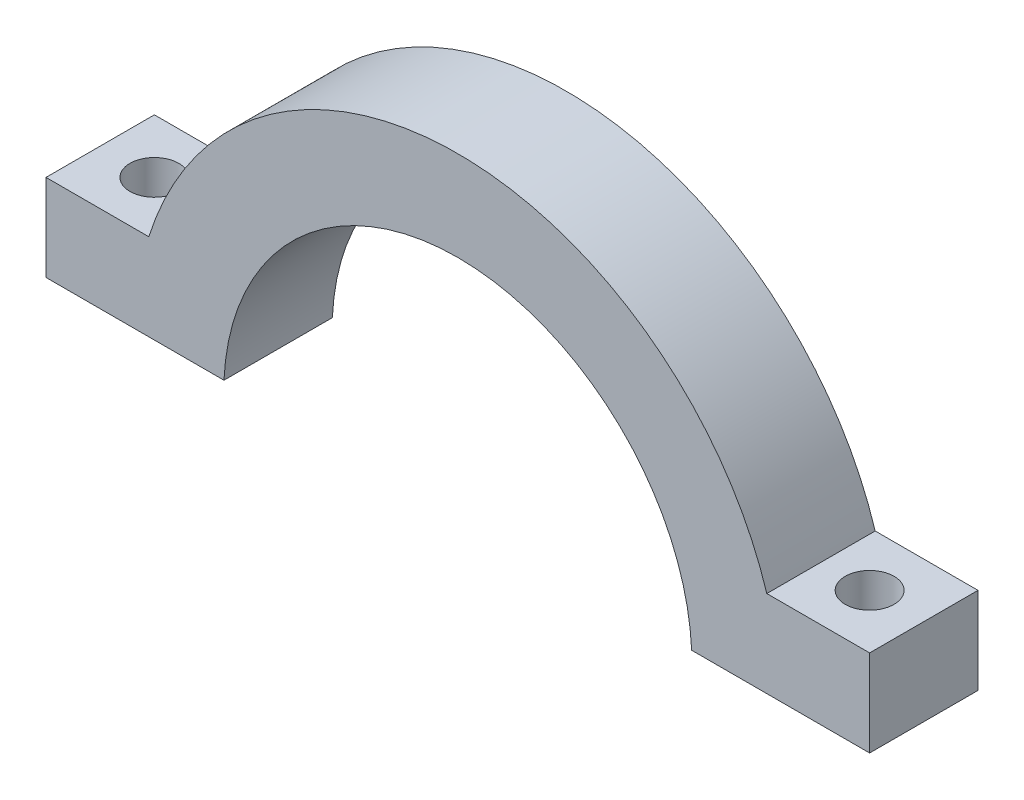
ISO-10303-21;
HEADER;
FILE_DESCRIPTION(('STEP AP214'),'2;1');
FILE_NAME('part.step','',(''),(''),'','','');
FILE_SCHEMA(('AUTOMOTIVE_DESIGN { 1 0 10303 214 1 1 1 1 }'));
ENDSEC;
DATA;
#1=APPLICATION_CONTEXT('core data for automotive mechanical design processes');
#2=APPLICATION_PROTOCOL_DEFINITION('international standard','automotive_design',2000,#1);
#3=PRODUCT_CONTEXT('',#1,'mechanical');
#4=PRODUCT('Part','Part','',(#3));
#5=PRODUCT_RELATED_PRODUCT_CATEGORY('part','',(#4));
#6=PRODUCT_DEFINITION_FORMATION('','',#4);
#7=PRODUCT_DEFINITION_CONTEXT('part definition',#1,'design');
#8=PRODUCT_DEFINITION('design','',#6,#7);
#9=PRODUCT_DEFINITION_SHAPE('','',#8);
#10=(LENGTH_UNIT() NAMED_UNIT(*) SI_UNIT(.MILLI.,.METRE.));
#11=(NAMED_UNIT(*) PLANE_ANGLE_UNIT() SI_UNIT($,.RADIAN.));
#12=(NAMED_UNIT(*) SI_UNIT($,.STERADIAN.) SOLID_ANGLE_UNIT());
#13=UNCERTAINTY_MEASURE_WITH_UNIT(LENGTH_MEASURE(1.E-05),#10,'distance_accuracy_value','');
#14=(GEOMETRIC_REPRESENTATION_CONTEXT(3) GLOBAL_UNCERTAINTY_ASSIGNED_CONTEXT((#13)) GLOBAL_UNIT_ASSIGNED_CONTEXT((#10,
#11,#12)) REPRESENTATION_CONTEXT('',''));
#15=CARTESIAN_POINT('',(0.,0.,0.));
#16=DIRECTION('',(0.,0.,1.));
#17=DIRECTION('',(1.,0.,0.));
#18=AXIS2_PLACEMENT_3D('',#15,#16,#17);
#19=CARTESIAN_POINT('',(241.3,6.35,63.5));
#20=DIRECTION('',(-1.,0.,0.));
#21=DIRECTION('',(0.,-1.,0.));
#22=AXIS2_PLACEMENT_3D('',#19,#20,#21);
#23=PLANE('',#22);
#24=DIRECTION('',(0.,1.,0.));
#25=VECTOR('',#24,1.);
#26=CARTESIAN_POINT('',(241.3,6.35,0.));
#27=LINE('',#26,#25);
#28=CARTESIAN_POINT('',(241.3,6.35,0.));
#29=VERTEX_POINT('',#28);
#30=CARTESIAN_POINT('',(241.3,57.15,0.));
#31=VERTEX_POINT('',#30);
#32=EDGE_CURVE('E443',#29,#31,#27,.T.);
#33=ORIENTED_EDGE('',*,*,#32,.T.);
#34=DIRECTION('',(0.,0.,-1.));
#35=VECTOR('',#34,1.);
#36=CARTESIAN_POINT('',(241.3,57.15,63.5));
#37=LINE('',#36,#35);
#38=CARTESIAN_POINT('',(241.3,57.15,63.5));
#39=VERTEX_POINT('',#38);
#40=EDGE_CURVE('E11',#39,#31,#37,.T.);
#41=ORIENTED_EDGE('',*,*,#40,.F.);
#42=DIRECTION('',(0.,1.,0.));
#43=VECTOR('',#42,1.);
#44=CARTESIAN_POINT('',(241.3,6.35,63.5));
#45=LINE('',#44,#43);
#46=CARTESIAN_POINT('',(241.3,6.35,63.5));
#47=VERTEX_POINT('',#46);
#48=EDGE_CURVE('E475',#47,#39,#45,.T.);
#49=ORIENTED_EDGE('',*,*,#48,.F.);
#50=DIRECTION('',(0.,0.,-1.));
#51=VECTOR('',#50,1.);
#52=CARTESIAN_POINT('',(241.3,6.35,63.5));
#53=LINE('',#52,#51);
#54=EDGE_CURVE('E456',#47,#29,#53,.T.);
#55=ORIENTED_EDGE('',*,*,#54,.T.);
#56=EDGE_LOOP('',(#33,#41,#49,#55));
#57=FACE_BOUND('',#56,.T.);
#58=ADVANCED_FACE('F375',(#57),#23,.F.);
#59=CARTESIAN_POINT('',(181.059646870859,57.15,63.5));
#60=DIRECTION('',(0.,-1.,0.));
#61=DIRECTION('',(0.,0.,-1.));
#62=AXIS2_PLACEMENT_3D('',#59,#60,#61);
#63=PLANE('',#62);
#64=CARTESIAN_POINT('',(209.55,57.1500000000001,31.75));
#65=DIRECTION('',(0.,1.,0.));
#66=DIRECTION('',(0.,0.,1.));
#67=AXIS2_PLACEMENT_3D('',#64,#65,#66);
#68=CIRCLE('',#67,14.2875);
#69=CARTESIAN_POINT('',(209.55,57.15,46.0375));
#70=VERTEX_POINT('',#69);
#71=EDGE_CURVE('E568',#70,#70,#68,.T.);
#72=ORIENTED_EDGE('',*,*,#71,.F.);
#73=EDGE_LOOP('',(#72));
#74=FACE_BOUND('',#73,.T.);
#75=DIRECTION('',(-1.,0.,0.));
#76=VECTOR('',#75,1.);
#77=CARTESIAN_POINT('',(181.059646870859,57.15,0.));
#78=LINE('',#77,#76);
#79=CARTESIAN_POINT('',(181.059646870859,57.15,0.));
#80=VERTEX_POINT('',#79);
#81=EDGE_CURVE('E439',#31,#80,#78,.T.);
#82=ORIENTED_EDGE('',*,*,#81,.T.);
#83=DIRECTION('',(0.,0.,-1.));
#84=VECTOR('',#83,1.);
#85=CARTESIAN_POINT('',(181.059646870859,57.15,63.5));
#86=LINE('',#85,#84);
#87=CARTESIAN_POINT('',(181.059646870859,57.15,63.5));
#88=VERTEX_POINT('',#87);
#89=EDGE_CURVE('E382',#88,#80,#86,.T.);
#90=ORIENTED_EDGE('',*,*,#89,.F.);
#91=DIRECTION('',(-1.,0.,0.));
#92=VECTOR('',#91,1.);
#93=CARTESIAN_POINT('',(181.059646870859,57.15,63.5));
#94=LINE('',#93,#92);
#95=EDGE_CURVE('E452',#39,#88,#94,.T.);
#96=ORIENTED_EDGE('',*,*,#95,.F.);
#97=ORIENTED_EDGE('',*,*,#40,.T.);
#98=EDGE_LOOP('',(#82,#90,#96,#97));
#99=FACE_BOUND('',#98,.T.);
#100=ADVANCED_FACE('F451',(#74,#99),#63,.F.);
#101=CARTESIAN_POINT('',(0.,0.,63.5));
#102=DIRECTION('',(0.,0.,-1.));
#103=DIRECTION('',(-1.,0.,0.));
#104=AXIS2_PLACEMENT_3D('',#101,#102,#103);
#105=CYLINDRICAL_SURFACE('',#104,189.865);
#106=CARTESIAN_POINT('',(0.,0.,0.));
#107=DIRECTION('',(0.,0.,1.));
#108=DIRECTION('',(1.,0.,0.));
#109=AXIS2_PLACEMENT_3D('',#106,#107,#108);
#110=CIRCLE('',#109,189.865);
#111=CARTESIAN_POINT('',(-181.059646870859,57.15,0.));
#112=VERTEX_POINT('',#111);
#113=EDGE_CURVE('E445',#80,#112,#110,.T.);
#114=ORIENTED_EDGE('',*,*,#113,.T.);
#115=DIRECTION('',(0.,0.,-1.));
#116=VECTOR('',#115,1.);
#117=CARTESIAN_POINT('',(-181.059646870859,57.15,63.5));
#118=LINE('',#117,#116);
#119=CARTESIAN_POINT('',(-181.059646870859,57.15,63.5));
#120=VERTEX_POINT('',#119);
#121=EDGE_CURVE('E501',#120,#112,#118,.T.);
#122=ORIENTED_EDGE('',*,*,#121,.F.);
#123=CARTESIAN_POINT('',(0.,0.,63.5));
#124=DIRECTION('',(0.,0.,1.));
#125=DIRECTION('',(1.,0.,0.));
#126=AXIS2_PLACEMENT_3D('',#123,#124,#125);
#127=CIRCLE('',#126,189.865);
#128=EDGE_CURVE('E478',#88,#120,#127,.T.);
#129=ORIENTED_EDGE('',*,*,#128,.F.);
#130=ORIENTED_EDGE('',*,*,#89,.T.);
#131=EDGE_LOOP('',(#114,#122,#129,#130));
#132=FACE_BOUND('',#131,.T.);
#133=ADVANCED_FACE('F505',(#132),#105,.T.);
#134=CARTESIAN_POINT('',(-181.059646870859,57.15,63.5));
#135=DIRECTION('',(0.,-1.,0.));
#136=DIRECTION('',(1.,0.,0.));
#137=AXIS2_PLACEMENT_3D('',#134,#135,#136);
#138=PLANE('',#137);
#139=CARTESIAN_POINT('',(-209.55,57.1500000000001,31.75));
#140=DIRECTION('',(0.,1.,0.));
#141=DIRECTION('',(0.,0.,1.));
#142=AXIS2_PLACEMENT_3D('',#139,#140,#141);
#143=CIRCLE('',#142,14.2875);
#144=CARTESIAN_POINT('',(-209.55,57.15,46.0375));
#145=VERTEX_POINT('',#144);
#146=EDGE_CURVE('E460',#145,#145,#143,.T.);
#147=ORIENTED_EDGE('',*,*,#146,.F.);
#148=EDGE_LOOP('',(#147));
#149=FACE_BOUND('',#148,.T.);
#150=DIRECTION('',(-1.,0.,0.));
#151=VECTOR('',#150,1.);
#152=CARTESIAN_POINT('',(-181.059646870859,57.15,0.));
#153=LINE('',#152,#151);
#154=CARTESIAN_POINT('',(-241.3,57.15,0.));
#155=VERTEX_POINT('',#154);
#156=EDGE_CURVE('E465',#112,#155,#153,.T.);
#157=ORIENTED_EDGE('',*,*,#156,.T.);
#158=DIRECTION('',(0.,0.,-1.));
#159=VECTOR('',#158,1.);
#160=CARTESIAN_POINT('',(-241.3,57.15,63.5));
#161=LINE('',#160,#159);
#162=CARTESIAN_POINT('',(-241.3,57.15,63.5));
#163=VERTEX_POINT('',#162);
#164=EDGE_CURVE('E498',#163,#155,#161,.T.);
#165=ORIENTED_EDGE('',*,*,#164,.F.);
#166=DIRECTION('',(-1.,0.,0.));
#167=VECTOR('',#166,1.);
#168=CARTESIAN_POINT('',(-181.059646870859,57.15,63.5));
#169=LINE('',#168,#167);
#170=EDGE_CURVE('E480',#120,#163,#169,.T.);
#171=ORIENTED_EDGE('',*,*,#170,.F.);
#172=ORIENTED_EDGE('',*,*,#121,.T.);
#173=EDGE_LOOP('',(#157,#165,#171,#172));
#174=FACE_BOUND('',#173,.T.);
#175=ADVANCED_FACE('F513',(#149,#174),#138,.F.);
#176=CARTESIAN_POINT('',(-241.3,6.35,63.5));
#177=DIRECTION('',(1.,0.,0.));
#178=DIRECTION('',(0.,1.,0.));
#179=AXIS2_PLACEMENT_3D('',#176,#177,#178);
#180=PLANE('',#179);
#181=DIRECTION('',(0.,-1.,0.));
#182=VECTOR('',#181,1.);
#183=CARTESIAN_POINT('',(-241.3,6.35,0.));
#184=LINE('',#183,#182);
#185=CARTESIAN_POINT('',(-241.3,6.35,0.));
#186=VERTEX_POINT('',#185);
#187=EDGE_CURVE('E467',#155,#186,#184,.T.);
#188=ORIENTED_EDGE('',*,*,#187,.T.);
#189=DIRECTION('',(0.,0.,-1.));
#190=VECTOR('',#189,1.);
#191=CARTESIAN_POINT('',(-241.3,6.35,63.5));
#192=LINE('',#191,#190);
#193=CARTESIAN_POINT('',(-241.3,6.35,63.5));
#194=VERTEX_POINT('',#193);
#195=EDGE_CURVE('E495',#194,#186,#192,.T.);
#196=ORIENTED_EDGE('',*,*,#195,.F.);
#197=DIRECTION('',(0.,-1.,0.));
#198=VECTOR('',#197,1.);
#199=CARTESIAN_POINT('',(-241.3,6.35,63.5));
#200=LINE('',#199,#198);
#201=EDGE_CURVE('E482',#163,#194,#200,.T.);
#202=ORIENTED_EDGE('',*,*,#201,.F.);
#203=ORIENTED_EDGE('',*,*,#164,.T.);
#204=EDGE_LOOP('',(#188,#196,#202,#203));
#205=FACE_BOUND('',#204,.T.);
#206=ADVANCED_FACE('F516',(#205),#180,.F.);
#207=CARTESIAN_POINT('',(-241.3,6.35,63.5));
#208=DIRECTION('',(0.,1.,0.));
#209=DIRECTION('',(-1.,0.,0.));
#210=AXIS2_PLACEMENT_3D('',#207,#208,#209);
#211=PLANE('',#210);
#212=CARTESIAN_POINT('',(-209.55,6.34999999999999,31.75));
#213=DIRECTION('',(0.,1.,0.));
#214=DIRECTION('',(0.,0.,1.));
#215=AXIS2_PLACEMENT_3D('',#212,#213,#214);
#216=CIRCLE('',#215,14.2875);
#217=CARTESIAN_POINT('',(-209.55,6.34999999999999,46.0375));
#218=VERTEX_POINT('',#217);
#219=EDGE_CURVE('E457',#218,#218,#216,.T.);
#220=ORIENTED_EDGE('',*,*,#219,.T.);
#221=EDGE_LOOP('',(#220));
#222=FACE_BOUND('',#221,.T.);
#223=DIRECTION('',(1.,0.,0.));
#224=VECTOR('',#223,1.);
#225=CARTESIAN_POINT('',(-241.3,6.35,0.));
#226=LINE('',#225,#224);
#227=CARTESIAN_POINT('',(-137.012930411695,6.34999999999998,0.));
#228=VERTEX_POINT('',#227);
#229=EDGE_CURVE('E469',#186,#228,#226,.T.);
#230=ORIENTED_EDGE('',*,*,#229,.T.);
#231=DIRECTION('',(0.,0.,-1.));
#232=VECTOR('',#231,1.);
#233=CARTESIAN_POINT('',(-137.012930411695,6.34999999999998,63.5));
#234=LINE('',#233,#232);
#235=CARTESIAN_POINT('',(-137.012930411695,6.34999999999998,63.5));
#236=VERTEX_POINT('',#235);
#237=EDGE_CURVE('E492',#236,#228,#234,.T.);
#238=ORIENTED_EDGE('',*,*,#237,.F.);
#239=DIRECTION('',(1.,0.,0.));
#240=VECTOR('',#239,1.);
#241=CARTESIAN_POINT('',(-241.3,6.35,63.5));
#242=LINE('',#241,#240);
#243=EDGE_CURVE('E484',#194,#236,#242,.T.);
#244=ORIENTED_EDGE('',*,*,#243,.F.);
#245=ORIENTED_EDGE('',*,*,#195,.T.);
#246=EDGE_LOOP('',(#230,#238,#244,#245));
#247=FACE_BOUND('',#246,.T.);
#248=ADVANCED_FACE('F521',(#222,#247),#211,.F.);
#249=CARTESIAN_POINT('',(0.,0.,63.5));
#250=DIRECTION('',(0.,0.,-1.));
#251=DIRECTION('',(-1.,0.,0.));
#252=AXIS2_PLACEMENT_3D('',#249,#250,#251);
#253=CYLINDRICAL_SURFACE('',#252,137.16);
#254=CARTESIAN_POINT('',(0.,0.,0.));
#255=DIRECTION('',(0.,0.,-1.));
#256=DIRECTION('',(1.,0.,0.));
#257=AXIS2_PLACEMENT_3D('',#254,#255,#256);
#258=CIRCLE('',#257,137.16);
#259=CARTESIAN_POINT('',(137.012930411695,6.35,0.));
#260=VERTEX_POINT('',#259);
#261=EDGE_CURVE('E471',#228,#260,#258,.T.);
#262=ORIENTED_EDGE('',*,*,#261,.T.);
#263=DIRECTION('',(0.,0.,-1.));
#264=VECTOR('',#263,1.);
#265=CARTESIAN_POINT('',(137.012930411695,6.35,63.5));
#266=LINE('',#265,#264);
#267=CARTESIAN_POINT('',(137.012930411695,6.35,63.5));
#268=VERTEX_POINT('',#267);
#269=EDGE_CURVE('E489',#268,#260,#266,.T.);
#270=ORIENTED_EDGE('',*,*,#269,.F.);
#271=CARTESIAN_POINT('',(0.,0.,63.5));
#272=DIRECTION('',(0.,0.,-1.));
#273=DIRECTION('',(1.,0.,0.));
#274=AXIS2_PLACEMENT_3D('',#271,#272,#273);
#275=CIRCLE('',#274,137.16);
#276=EDGE_CURVE('E394',#236,#268,#275,.T.);
#277=ORIENTED_EDGE('',*,*,#276,.F.);
#278=ORIENTED_EDGE('',*,*,#237,.T.);
#279=EDGE_LOOP('',(#262,#270,#277,#278));
#280=FACE_BOUND('',#279,.T.);
#281=ADVANCED_FACE('F524',(#280),#253,.F.);
#282=CARTESIAN_POINT('',(137.012930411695,6.35,63.5));
#283=DIRECTION('',(0.,1.,0.));
#284=DIRECTION('',(-1.,0.,0.));
#285=AXIS2_PLACEMENT_3D('',#282,#283,#284);
#286=PLANE('',#285);
#287=CARTESIAN_POINT('',(209.55,6.34999999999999,31.75));
#288=DIRECTION('',(0.,1.,0.));
#289=DIRECTION('',(0.,0.,1.));
#290=AXIS2_PLACEMENT_3D('',#287,#288,#289);
#291=CIRCLE('',#290,14.2875);
#292=CARTESIAN_POINT('',(209.55,6.34999999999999,46.0375));
#293=VERTEX_POINT('',#292);
#294=EDGE_CURVE('E567',#293,#293,#291,.T.);
#295=ORIENTED_EDGE('',*,*,#294,.T.);
#296=EDGE_LOOP('',(#295));
#297=FACE_BOUND('',#296,.T.);
#298=DIRECTION('',(1.,0.,0.));
#299=VECTOR('',#298,1.);
#300=CARTESIAN_POINT('',(137.012930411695,6.35,0.));
#301=LINE('',#300,#299);
#302=EDGE_CURVE('E473',#260,#29,#301,.T.);
#303=ORIENTED_EDGE('',*,*,#302,.T.);
#304=ORIENTED_EDGE('',*,*,#54,.F.);
#305=DIRECTION('',(1.,0.,0.));
#306=VECTOR('',#305,1.);
#307=CARTESIAN_POINT('',(137.012930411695,6.35,63.5));
#308=LINE('',#307,#306);
#309=EDGE_CURVE('E389',#268,#47,#308,.T.);
#310=ORIENTED_EDGE('',*,*,#309,.F.);
#311=ORIENTED_EDGE('',*,*,#269,.T.);
#312=EDGE_LOOP('',(#303,#304,#310,#311));
#313=FACE_BOUND('',#312,.T.);
#314=ADVANCED_FACE('F526',(#297,#313),#286,.F.);
#315=CARTESIAN_POINT('',(0.,0.,63.5));
#316=DIRECTION('',(0.,0.,1.));
#317=DIRECTION('',(1.,0.,0.));
#318=AXIS2_PLACEMENT_3D('',#315,#316,#317);
#319=PLANE('',#318);
#320=ORIENTED_EDGE('',*,*,#48,.T.);
#321=ORIENTED_EDGE('',*,*,#95,.T.);
#322=ORIENTED_EDGE('',*,*,#128,.T.);
#323=ORIENTED_EDGE('',*,*,#170,.T.);
#324=ORIENTED_EDGE('',*,*,#201,.T.);
#325=ORIENTED_EDGE('',*,*,#243,.T.);
#326=ORIENTED_EDGE('',*,*,#276,.T.);
#327=ORIENTED_EDGE('',*,*,#309,.T.);
#328=EDGE_LOOP('',(#320,#321,#322,#323,#324,#325,#326,#327));
#329=FACE_BOUND('',#328,.T.);
#330=ADVANCED_FACE('F508',(#329),#319,.T.);
#331=CARTESIAN_POINT('',(0.,0.,0.));
#332=DIRECTION('',(0.,0.,1.));
#333=DIRECTION('',(1.,0.,0.));
#334=AXIS2_PLACEMENT_3D('',#331,#332,#333);
#335=PLANE('',#334);
#336=ORIENTED_EDGE('',*,*,#32,.F.);
#337=ORIENTED_EDGE('',*,*,#302,.F.);
#338=ORIENTED_EDGE('',*,*,#261,.F.);
#339=ORIENTED_EDGE('',*,*,#229,.F.);
#340=ORIENTED_EDGE('',*,*,#187,.F.);
#341=ORIENTED_EDGE('',*,*,#156,.F.);
#342=ORIENTED_EDGE('',*,*,#113,.F.);
#343=ORIENTED_EDGE('',*,*,#81,.F.);
#344=EDGE_LOOP('',(#336,#337,#338,#339,#340,#341,#342,#343));
#345=FACE_BOUND('',#344,.T.);
#346=ADVANCED_FACE('F440',(#345),#335,.F.);
#347=CARTESIAN_POINT('',(-209.55,6.34999999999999,31.75));
#348=DIRECTION('',(0.,1.,0.));
#349=DIRECTION('',(0.,0.,1.));
#350=AXIS2_PLACEMENT_3D('',#347,#348,#349);
#351=CYLINDRICAL_SURFACE('',#350,14.2875);
#352=CARTESIAN_POINT('',(-209.55,6.34999999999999,46.0375));
#353=CARTESIAN_POINT('',(-209.55,6.87916666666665,46.0375));
#354=CARTESIAN_POINT('',(-209.55,7.40833333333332,46.0375));
#355=CARTESIAN_POINT('',(-209.55,8.46666666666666,46.0375));
#356=CARTESIAN_POINT('',(-209.55,8.99583333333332,46.0375));
#357=CARTESIAN_POINT('',(-209.55,10.0541666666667,46.0375));
#358=CARTESIAN_POINT('',(-209.55,10.5833333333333,46.0375));
#359=CARTESIAN_POINT('',(-209.55,11.6416666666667,46.0375));
#360=CARTESIAN_POINT('',(-209.55,12.1708333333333,46.0375));
#361=CARTESIAN_POINT('',(-209.55,13.2291666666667,46.0375));
#362=CARTESIAN_POINT('',(-209.55,13.7583333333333,46.0375));
#363=CARTESIAN_POINT('',(-209.55,14.8166666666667,46.0375));
#364=CARTESIAN_POINT('',(-209.55,15.3458333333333,46.0375));
#365=CARTESIAN_POINT('',(-209.55,16.4041666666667,46.0375));
#366=CARTESIAN_POINT('',(-209.55,16.9333333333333,46.0375));
#367=CARTESIAN_POINT('',(-209.55,17.9916666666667,46.0375));
#368=CARTESIAN_POINT('',(-209.55,18.5208333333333,46.0375));
#369=CARTESIAN_POINT('',(-209.55,19.5791666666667,46.0375));
#370=CARTESIAN_POINT('',(-209.55,20.1083333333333,46.0375));
#371=CARTESIAN_POINT('',(-209.55,21.1666666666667,46.0375));
#372=CARTESIAN_POINT('',(-209.55,21.6958333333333,46.0375));
#373=CARTESIAN_POINT('',(-209.55,22.7541666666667,46.0375));
#374=CARTESIAN_POINT('',(-209.55,23.2833333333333,46.0375));
#375=CARTESIAN_POINT('',(-209.55,24.3416666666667,46.0375));
#376=CARTESIAN_POINT('',(-209.55,24.8708333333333,46.0375));
#377=CARTESIAN_POINT('',(-209.55,25.9291666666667,46.0375));
#378=CARTESIAN_POINT('',(-209.55,26.4583333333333,46.0375));
#379=CARTESIAN_POINT('',(-209.55,27.5166666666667,46.0375));
#380=CARTESIAN_POINT('',(-209.55,28.0458333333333,46.0375));
#381=CARTESIAN_POINT('',(-209.55,29.1041666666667,46.0375));
#382=CARTESIAN_POINT('',(-209.55,29.6333333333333,46.0375));
#383=CARTESIAN_POINT('',(-209.55,30.6916666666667,46.0375));
#384=CARTESIAN_POINT('',(-209.55,31.2208333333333,46.0375));
#385=CARTESIAN_POINT('',(-209.55,32.2791666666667,46.0375));
#386=CARTESIAN_POINT('',(-209.55,32.8083333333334,46.0375));
#387=CARTESIAN_POINT('',(-209.55,33.8666666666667,46.0375));
#388=CARTESIAN_POINT('',(-209.55,34.3958333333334,46.0375));
#389=CARTESIAN_POINT('',(-209.55,35.4541666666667,46.0375));
#390=CARTESIAN_POINT('',(-209.55,35.9833333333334,46.0375));
#391=CARTESIAN_POINT('',(-209.55,37.0416666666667,46.0375));
#392=CARTESIAN_POINT('',(-209.55,37.5708333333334,46.0375));
#393=CARTESIAN_POINT('',(-209.55,38.6291666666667,46.0375));
#394=CARTESIAN_POINT('',(-209.55,39.1583333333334,46.0375));
#395=CARTESIAN_POINT('',(-209.55,40.2166666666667,46.0375));
#396=CARTESIAN_POINT('',(-209.55,40.7458333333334,46.0375));
#397=CARTESIAN_POINT('',(-209.55,41.8041666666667,46.0375));
#398=CARTESIAN_POINT('',(-209.55,42.3333333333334,46.0375));
#399=CARTESIAN_POINT('',(-209.55,43.3916666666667,46.0375));
#400=CARTESIAN_POINT('',(-209.55,43.9208333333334,46.0375));
#401=CARTESIAN_POINT('',(-209.55,44.9791666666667,46.0375));
#402=CARTESIAN_POINT('',(-209.55,45.5083333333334,46.0375));
#403=CARTESIAN_POINT('',(-209.55,46.5666666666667,46.0375));
#404=CARTESIAN_POINT('',(-209.55,47.0958333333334,46.0375));
#405=CARTESIAN_POINT('',(-209.55,48.1541666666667,46.0375));
#406=CARTESIAN_POINT('',(-209.55,48.6833333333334,46.0375));
#407=CARTESIAN_POINT('',(-209.55,49.7416666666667,46.0375));
#408=CARTESIAN_POINT('',(-209.55,50.2708333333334,46.0375));
#409=CARTESIAN_POINT('',(-209.55,51.3291666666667,46.0375));
#410=CARTESIAN_POINT('',(-209.55,51.8583333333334,46.0375));
#411=CARTESIAN_POINT('',(-209.55,52.9166666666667,46.0375));
#412=CARTESIAN_POINT('',(-209.55,53.4458333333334,46.0375));
#413=CARTESIAN_POINT('',(-209.55,54.5041666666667,46.0375));
#414=CARTESIAN_POINT('',(-209.55,55.0333333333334,46.0375));
#415=CARTESIAN_POINT('',(-209.55,56.0916666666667,46.0375));
#416=CARTESIAN_POINT('',(-209.55,56.6208333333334,46.0375));
#417=CARTESIAN_POINT('',(-209.55,57.15,46.0375));
#418=B_SPLINE_CURVE_WITH_KNOTS('',3,(#352,#353,#354,#355,#356,#357,#358,#359,#360,#361,#362,
#363,#364,#365,#366,#367,#368,#369,#370,#371,#372,#373,#374,#375,#376,#377,#378,#379,#380,#381,
#382,#383,#384,#385,#386,#387,#388,#389,#390,#391,#392,#393,#394,#395,#396,#397,#398,#399,#400,
#401,#402,#403,#404,#405,#406,#407,#408,#409,#410,#411,#412,#413,#414,#415,#416,#417),
.UNSPECIFIED.,.F.,.F.,(4,2,2,2,2,2,2,2,2,2,2,2,2,2,2,2,2,2,2,2,2,2,2,2,2,2,2,2,2,2,2,2,4),(0.,
1.5875,3.175,4.76250000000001,6.35000000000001,7.93750000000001,9.52500000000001,11.1125,12.7,
14.2875,15.875,17.4625,19.05,20.6375,22.225,23.8125,25.4,26.9875,28.575,30.1625,31.75,33.3375,
34.925,36.5125,38.1,39.6875,41.275,42.8625,44.4500000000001,46.0375000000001,47.6250000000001,
49.2125000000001,50.8000000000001),.UNSPECIFIED.);
#419=EDGE_CURVE('BSEAM561',#218,#145,#418,.T.);
#420=ORIENTED_EDGE('',*,*,#219,.F.);
#421=ORIENTED_EDGE('',*,*,#146,.T.);
#422=ORIENTED_EDGE('',*,*,#419,.T.);
#423=ORIENTED_EDGE('',*,*,#419,.F.);
#424=EDGE_LOOP('',(#420,#422,#421,#423));
#425=FACE_BOUND('',#424,.T.);
#426=ADVANCED_FACE('F561',(#425),#351,.F.);
#427=CARTESIAN_POINT('',(209.55,6.34999999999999,31.75));
#428=DIRECTION('',(0.,1.,0.));
#429=DIRECTION('',(0.,0.,1.));
#430=AXIS2_PLACEMENT_3D('',#427,#428,#429);
#431=CYLINDRICAL_SURFACE('',#430,14.2875);
#432=CARTESIAN_POINT('',(209.55,6.34999999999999,46.0375));
#433=CARTESIAN_POINT('',(209.55,6.87916666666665,46.0375));
#434=CARTESIAN_POINT('',(209.55,7.40833333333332,46.0375));
#435=CARTESIAN_POINT('',(209.55,8.46666666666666,46.0375));
#436=CARTESIAN_POINT('',(209.55,8.99583333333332,46.0375));
#437=CARTESIAN_POINT('',(209.55,10.0541666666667,46.0375));
#438=CARTESIAN_POINT('',(209.55,10.5833333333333,46.0375));
#439=CARTESIAN_POINT('',(209.55,11.6416666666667,46.0375));
#440=CARTESIAN_POINT('',(209.55,12.1708333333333,46.0375));
#441=CARTESIAN_POINT('',(209.55,13.2291666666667,46.0375));
#442=CARTESIAN_POINT('',(209.55,13.7583333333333,46.0375));
#443=CARTESIAN_POINT('',(209.55,14.8166666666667,46.0375));
#444=CARTESIAN_POINT('',(209.55,15.3458333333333,46.0375));
#445=CARTESIAN_POINT('',(209.55,16.4041666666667,46.0375));
#446=CARTESIAN_POINT('',(209.55,16.9333333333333,46.0375));
#447=CARTESIAN_POINT('',(209.55,17.9916666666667,46.0375));
#448=CARTESIAN_POINT('',(209.55,18.5208333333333,46.0375));
#449=CARTESIAN_POINT('',(209.55,19.5791666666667,46.0375));
#450=CARTESIAN_POINT('',(209.55,20.1083333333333,46.0375));
#451=CARTESIAN_POINT('',(209.55,21.1666666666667,46.0375));
#452=CARTESIAN_POINT('',(209.55,21.6958333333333,46.0375));
#453=CARTESIAN_POINT('',(209.55,22.7541666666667,46.0375));
#454=CARTESIAN_POINT('',(209.55,23.2833333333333,46.0375));
#455=CARTESIAN_POINT('',(209.55,24.3416666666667,46.0375));
#456=CARTESIAN_POINT('',(209.55,24.8708333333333,46.0375));
#457=CARTESIAN_POINT('',(209.55,25.9291666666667,46.0375));
#458=CARTESIAN_POINT('',(209.55,26.4583333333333,46.0375));
#459=CARTESIAN_POINT('',(209.55,27.5166666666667,46.0375));
#460=CARTESIAN_POINT('',(209.55,28.0458333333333,46.0375));
#461=CARTESIAN_POINT('',(209.55,29.1041666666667,46.0375));
#462=CARTESIAN_POINT('',(209.55,29.6333333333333,46.0375));
#463=CARTESIAN_POINT('',(209.55,30.6916666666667,46.0375));
#464=CARTESIAN_POINT('',(209.55,31.2208333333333,46.0375));
#465=CARTESIAN_POINT('',(209.55,32.2791666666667,46.0375));
#466=CARTESIAN_POINT('',(209.55,32.8083333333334,46.0375));
#467=CARTESIAN_POINT('',(209.55,33.8666666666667,46.0375));
#468=CARTESIAN_POINT('',(209.55,34.3958333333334,46.0375));
#469=CARTESIAN_POINT('',(209.55,35.4541666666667,46.0375));
#470=CARTESIAN_POINT('',(209.55,35.9833333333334,46.0375));
#471=CARTESIAN_POINT('',(209.55,37.0416666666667,46.0375));
#472=CARTESIAN_POINT('',(209.55,37.5708333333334,46.0375));
#473=CARTESIAN_POINT('',(209.55,38.6291666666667,46.0375));
#474=CARTESIAN_POINT('',(209.55,39.1583333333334,46.0375));
#475=CARTESIAN_POINT('',(209.55,40.2166666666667,46.0375));
#476=CARTESIAN_POINT('',(209.55,40.7458333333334,46.0375));
#477=CARTESIAN_POINT('',(209.55,41.8041666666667,46.0375));
#478=CARTESIAN_POINT('',(209.55,42.3333333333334,46.0375));
#479=CARTESIAN_POINT('',(209.55,43.3916666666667,46.0375));
#480=CARTESIAN_POINT('',(209.55,43.9208333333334,46.0375));
#481=CARTESIAN_POINT('',(209.55,44.9791666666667,46.0375));
#482=CARTESIAN_POINT('',(209.55,45.5083333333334,46.0375));
#483=CARTESIAN_POINT('',(209.55,46.5666666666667,46.0375));
#484=CARTESIAN_POINT('',(209.55,47.0958333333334,46.0375));
#485=CARTESIAN_POINT('',(209.55,48.1541666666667,46.0375));
#486=CARTESIAN_POINT('',(209.55,48.6833333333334,46.0375));
#487=CARTESIAN_POINT('',(209.55,49.7416666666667,46.0375));
#488=CARTESIAN_POINT('',(209.55,50.2708333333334,46.0375));
#489=CARTESIAN_POINT('',(209.55,51.3291666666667,46.0375));
#490=CARTESIAN_POINT('',(209.55,51.8583333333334,46.0375));
#491=CARTESIAN_POINT('',(209.55,52.9166666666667,46.0375));
#492=CARTESIAN_POINT('',(209.55,53.4458333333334,46.0375));
#493=CARTESIAN_POINT('',(209.55,54.5041666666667,46.0375));
#494=CARTESIAN_POINT('',(209.55,55.0333333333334,46.0375));
#495=CARTESIAN_POINT('',(209.55,56.0916666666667,46.0375));
#496=CARTESIAN_POINT('',(209.55,56.6208333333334,46.0375));
#497=CARTESIAN_POINT('',(209.55,57.15,46.0375));
#498=B_SPLINE_CURVE_WITH_KNOTS('',3,(#432,#433,#434,#435,#436,#437,#438,#439,#440,#441,#442,
#443,#444,#445,#446,#447,#448,#449,#450,#451,#452,#453,#454,#455,#456,#457,#458,#459,#460,#461,
#462,#463,#464,#465,#466,#467,#468,#469,#470,#471,#472,#473,#474,#475,#476,#477,#478,#479,#480,
#481,#482,#483,#484,#485,#486,#487,#488,#489,#490,#491,#492,#493,#494,#495,#496,#497),
.UNSPECIFIED.,.F.,.F.,(4,2,2,2,2,2,2,2,2,2,2,2,2,2,2,2,2,2,2,2,2,2,2,2,2,2,2,2,2,2,2,2,4),(0.,
1.5875,3.175,4.76250000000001,6.35000000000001,7.93750000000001,9.52500000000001,11.1125,12.7,
14.2875,15.875,17.4625,19.05,20.6375,22.225,23.8125,25.4,26.9875,28.575,30.1625,31.75,33.3375,
34.925,36.5125,38.1,39.6875,41.275,42.8625,44.4500000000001,46.0375000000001,47.6250000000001,
49.2125000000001,50.8000000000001),.UNSPECIFIED.);
#499=EDGE_CURVE('BSEAM563',#293,#70,#498,.T.);
#500=ORIENTED_EDGE('',*,*,#294,.F.);
#501=ORIENTED_EDGE('',*,*,#71,.T.);
#502=ORIENTED_EDGE('',*,*,#499,.T.);
#503=ORIENTED_EDGE('',*,*,#499,.F.);
#504=EDGE_LOOP('',(#500,#502,#501,#503));
#505=FACE_BOUND('',#504,.T.);
#506=ADVANCED_FACE('F563',(#505),#431,.F.);
#507=CLOSED_SHELL('',(#58,#100,#133,#175,#206,#248,#281,#314,#330,#346,#426,#506));
#508=MANIFOLD_SOLID_BREP('B2',#507);
#509=ADVANCED_BREP_SHAPE_REPRESENTATION('',(#18,#508),#14);
#510=SHAPE_DEFINITION_REPRESENTATION(#9,#509);
ENDSEC;
END-ISO-10303-21;
